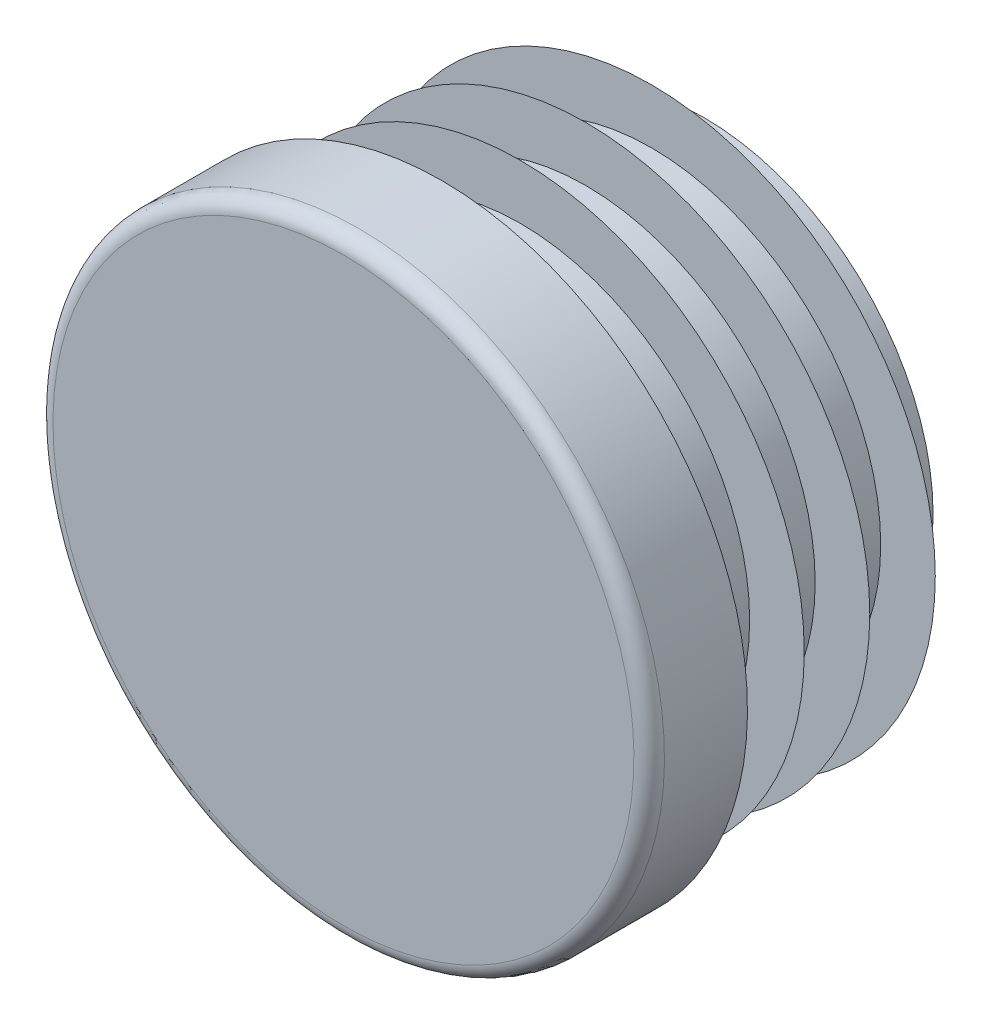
ISO-10303-21;
HEADER;
FILE_DESCRIPTION(('STEP AP214'),'2;1');
FILE_NAME('part.step','',(''),(''),'','','');
FILE_SCHEMA(('AUTOMOTIVE_DESIGN { 1 0 10303 214 1 1 1 1 }'));
ENDSEC;
DATA;
#1=APPLICATION_CONTEXT('core data for automotive mechanical design processes');
#2=APPLICATION_PROTOCOL_DEFINITION('international standard','automotive_design',2000,#1);
#3=PRODUCT_CONTEXT('',#1,'mechanical');
#4=PRODUCT('Part','Part','',(#3));
#5=PRODUCT_RELATED_PRODUCT_CATEGORY('part','',(#4));
#6=PRODUCT_DEFINITION_FORMATION('','',#4);
#7=PRODUCT_DEFINITION_CONTEXT('part definition',#1,'design');
#8=PRODUCT_DEFINITION('design','',#6,#7);
#9=PRODUCT_DEFINITION_SHAPE('','',#8);
#10=(LENGTH_UNIT() NAMED_UNIT(*) SI_UNIT(.MILLI.,.METRE.));
#11=(NAMED_UNIT(*) PLANE_ANGLE_UNIT() SI_UNIT($,.RADIAN.));
#12=(NAMED_UNIT(*) SI_UNIT($,.STERADIAN.) SOLID_ANGLE_UNIT());
#13=UNCERTAINTY_MEASURE_WITH_UNIT(LENGTH_MEASURE(1.E-05),#10,'distance_accuracy_value','');
#14=(GEOMETRIC_REPRESENTATION_CONTEXT(3) GLOBAL_UNCERTAINTY_ASSIGNED_CONTEXT((#13)) GLOBAL_UNIT_ASSIGNED_CONTEXT((#10,
#11,#12)) REPRESENTATION_CONTEXT('',''));
#15=CARTESIAN_POINT('',(0.,0.,0.));
#16=DIRECTION('',(0.,0.,1.));
#17=DIRECTION('',(1.,0.,0.));
#18=AXIS2_PLACEMENT_3D('',#15,#16,#17);
#19=CARTESIAN_POINT('',(0.,0.,4.5));
#20=DIRECTION('',(0.,0.,-1.));
#21=DIRECTION('',(0.,1.,0.));
#22=AXIS2_PLACEMENT_3D('',#19,#20,#21);
#23=PLANE('',#22);
#24=CARTESIAN_POINT('',(0.,0.,4.5));
#25=DIRECTION('',(0.,0.,-1.));
#26=DIRECTION('',(0.,1.,0.));
#27=AXIS2_PLACEMENT_3D('',#24,#25,#26);
#28=CIRCLE('',#27,13.3);
#29=CARTESIAN_POINT('',(0.,13.3,4.5));
#30=VERTEX_POINT('',#29);
#31=EDGE_CURVE('E8',#30,#30,#28,.T.);
#32=ORIENTED_EDGE('',*,*,#31,.F.);
#33=EDGE_LOOP('',(#32));
#34=FACE_BOUND('',#33,.T.);
#35=ADVANCED_FACE('F12',(#34),#23,.F.);
#36=CARTESIAN_POINT('',(0.,0.,3.8));
#37=DIRECTION('',(0.,0.,-1.));
#38=DIRECTION('',(0.,1.,0.));
#39=AXIS2_PLACEMENT_3D('',#36,#37,#38);
#40=TOROIDAL_SURFACE('',#39,13.3,0.7);
#41=ORIENTED_EDGE('',*,*,#31,.T.);
#42=EDGE_LOOP('',(#41));
#43=FACE_BOUND('',#42,.T.);
#44=CARTESIAN_POINT('',(0.,0.,3.8));
#45=DIRECTION('',(0.,0.,-1.));
#46=DIRECTION('',(0.,1.,0.));
#47=AXIS2_PLACEMENT_3D('',#44,#45,#46);
#48=CIRCLE('',#47,14.);
#49=CARTESIAN_POINT('',(0.,14.,3.8));
#50=VERTEX_POINT('',#49);
#51=EDGE_CURVE('E18',#50,#50,#48,.T.);
#52=ORIENTED_EDGE('',*,*,#51,.F.);
#53=EDGE_LOOP('',(#52));
#54=FACE_BOUND('',#53,.T.);
#55=ADVANCED_FACE('F159',(#43,#54),#40,.T.);
#56=CARTESIAN_POINT('',(0.,0.,-12.));
#57=DIRECTION('',(0.,0.,-1.));
#58=DIRECTION('',(0.,1.,0.));
#59=AXIS2_PLACEMENT_3D('',#56,#57,#58);
#60=CYLINDRICAL_SURFACE('',#59,14.);
#61=CARTESIAN_POINT('',(0.,0.,0.));
#62=DIRECTION('',(0.,0.,-1.));
#63=DIRECTION('',(0.,1.,0.));
#64=AXIS2_PLACEMENT_3D('',#61,#62,#63);
#65=CIRCLE('',#64,14.);
#66=CARTESIAN_POINT('',(0.,14.,0.));
#67=VERTEX_POINT('',#66);
#68=EDGE_CURVE('E22',#67,#67,#65,.T.);
#69=ORIENTED_EDGE('',*,*,#68,.F.);
#70=EDGE_LOOP('',(#69));
#71=FACE_BOUND('',#70,.T.);
#72=ORIENTED_EDGE('',*,*,#51,.T.);
#73=EDGE_LOOP('',(#72));
#74=FACE_BOUND('',#73,.T.);
#75=ADVANCED_FACE('F154',(#71,#74),#60,.T.);
#76=CARTESIAN_POINT('',(14.,0.,0.));
#77=DIRECTION('',(0.,0.,1.));
#78=DIRECTION('',(0.,-1.,0.));
#79=AXIS2_PLACEMENT_3D('',#76,#77,#78);
#80=PLANE('',#79);
#81=CARTESIAN_POINT('',(0.,0.,0.));
#82=DIRECTION('',(0.,0.,-1.));
#83=DIRECTION('',(0.,1.,0.));
#84=AXIS2_PLACEMENT_3D('',#81,#82,#83);
#85=CIRCLE('',#84,10.5);
#86=CARTESIAN_POINT('',(0.,10.5,0.));
#87=VERTEX_POINT('',#86);
#88=EDGE_CURVE('E26',#87,#87,#85,.T.);
#89=ORIENTED_EDGE('',*,*,#88,.F.);
#90=EDGE_LOOP('',(#89));
#91=FACE_BOUND('',#90,.T.);
#92=ORIENTED_EDGE('',*,*,#68,.T.);
#93=EDGE_LOOP('',(#92));
#94=FACE_BOUND('',#93,.T.);
#95=ADVANCED_FACE('F148',(#91,#94),#80,.F.);
#96=CARTESIAN_POINT('',(0.,0.,-12.));
#97=DIRECTION('',(0.,0.,-1.));
#98=DIRECTION('',(0.,1.,0.));
#99=AXIS2_PLACEMENT_3D('',#96,#97,#98);
#100=CYLINDRICAL_SURFACE('',#99,10.5);
#101=CARTESIAN_POINT('',(0.,0.,-0.6));
#102=DIRECTION('',(0.,0.,-1.));
#103=DIRECTION('',(0.,1.,0.));
#104=AXIS2_PLACEMENT_3D('',#101,#102,#103);
#105=CIRCLE('',#104,10.5);
#106=CARTESIAN_POINT('',(0.,10.5,-0.6));
#107=VERTEX_POINT('',#106);
#108=EDGE_CURVE('E31',#107,#107,#105,.T.);
#109=ORIENTED_EDGE('',*,*,#108,.F.);
#110=EDGE_LOOP('',(#109));
#111=FACE_BOUND('',#110,.T.);
#112=ORIENTED_EDGE('',*,*,#88,.T.);
#113=EDGE_LOOP('',(#112));
#114=FACE_BOUND('',#113,.T.);
#115=ADVANCED_FACE('F142',(#111,#114),#100,.T.);
#116=CARTESIAN_POINT('',(10.5,0.,-0.6));
#117=DIRECTION('',(0.,0.,-1.));
#118=DIRECTION('',(0.,1.,0.));
#119=AXIS2_PLACEMENT_3D('',#116,#117,#118);
#120=PLANE('',#119);
#121=CARTESIAN_POINT('',(0.,0.,-0.6));
#122=DIRECTION('',(0.,0.,-1.));
#123=DIRECTION('',(0.,1.,0.));
#124=AXIS2_PLACEMENT_3D('',#121,#122,#123);
#125=CIRCLE('',#124,13.);
#126=CARTESIAN_POINT('',(0.,13.,-0.6));
#127=VERTEX_POINT('',#126);
#128=EDGE_CURVE('E34',#127,#127,#125,.T.);
#129=ORIENTED_EDGE('',*,*,#128,.F.);
#130=EDGE_LOOP('',(#129));
#131=FACE_BOUND('',#130,.T.);
#132=ORIENTED_EDGE('',*,*,#108,.T.);
#133=EDGE_LOOP('',(#132));
#134=FACE_BOUND('',#133,.T.);
#135=ADVANCED_FACE('F136',(#131,#134),#120,.F.);
#136=CARTESIAN_POINT('',(0.,0.,-0.6));
#137=DIRECTION('',(0.,0.,1.));
#138=DIRECTION('',(0.,-1.,0.));
#139=AXIS2_PLACEMENT_3D('',#136,#137,#138);
#140=CONICAL_SURFACE('',#139,13.,0.959931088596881);
#141=CARTESIAN_POINT('',(0.,0.,-2.35051884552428));
#142=DIRECTION('',(0.,0.,-1.));
#143=DIRECTION('',(0.,1.,0.));
#144=AXIS2_PLACEMENT_3D('',#141,#142,#143);
#145=CIRCLE('',#144,10.5);
#146=CARTESIAN_POINT('',(0.,10.5,-2.35051884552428));
#147=VERTEX_POINT('',#146);
#148=EDGE_CURVE('E37',#147,#147,#145,.T.);
#149=ORIENTED_EDGE('',*,*,#148,.F.);
#150=EDGE_LOOP('',(#149));
#151=FACE_BOUND('',#150,.T.);
#152=ORIENTED_EDGE('',*,*,#128,.T.);
#153=EDGE_LOOP('',(#152));
#154=FACE_BOUND('',#153,.T.);
#155=ADVANCED_FACE('F130',(#151,#154),#140,.T.);
#156=CARTESIAN_POINT('',(0.,0.,-12.));
#157=DIRECTION('',(0.,0.,-1.));
#158=DIRECTION('',(0.,1.,0.));
#159=AXIS2_PLACEMENT_3D('',#156,#157,#158);
#160=CYLINDRICAL_SURFACE('',#159,10.5);
#161=CARTESIAN_POINT('',(0.,0.,-3.6));
#162=DIRECTION('',(0.,0.,-1.));
#163=DIRECTION('',(0.,1.,0.));
#164=AXIS2_PLACEMENT_3D('',#161,#162,#163);
#165=CIRCLE('',#164,10.5);
#166=CARTESIAN_POINT('',(0.,10.5,-3.6));
#167=VERTEX_POINT('',#166);
#168=EDGE_CURVE('E40',#167,#167,#165,.T.);
#169=ORIENTED_EDGE('',*,*,#168,.F.);
#170=EDGE_LOOP('',(#169));
#171=FACE_BOUND('',#170,.T.);
#172=ORIENTED_EDGE('',*,*,#148,.T.);
#173=EDGE_LOOP('',(#172));
#174=FACE_BOUND('',#173,.T.);
#175=ADVANCED_FACE('F124',(#171,#174),#160,.T.);
#176=CARTESIAN_POINT('',(10.5,0.,-3.6));
#177=DIRECTION('',(0.,0.,-1.));
#178=DIRECTION('',(0.,1.,0.));
#179=AXIS2_PLACEMENT_3D('',#176,#177,#178);
#180=PLANE('',#179);
#181=CARTESIAN_POINT('',(0.,0.,-3.6));
#182=DIRECTION('',(0.,0.,-1.));
#183=DIRECTION('',(0.,1.,0.));
#184=AXIS2_PLACEMENT_3D('',#181,#182,#183);
#185=CIRCLE('',#184,13.);
#186=CARTESIAN_POINT('',(0.,13.,-3.6));
#187=VERTEX_POINT('',#186);
#188=EDGE_CURVE('E43',#187,#187,#185,.T.);
#189=ORIENTED_EDGE('',*,*,#188,.F.);
#190=EDGE_LOOP('',(#189));
#191=FACE_BOUND('',#190,.T.);
#192=ORIENTED_EDGE('',*,*,#168,.T.);
#193=EDGE_LOOP('',(#192));
#194=FACE_BOUND('',#193,.T.);
#195=ADVANCED_FACE('F118',(#191,#194),#180,.F.);
#196=CARTESIAN_POINT('',(0.,0.,-3.6));
#197=DIRECTION('',(0.,0.,1.));
#198=DIRECTION('',(0.,-1.,0.));
#199=AXIS2_PLACEMENT_3D('',#196,#197,#198);
#200=CONICAL_SURFACE('',#199,13.,0.959931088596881);
#201=CARTESIAN_POINT('',(0.,0.,-5.35051884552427));
#202=DIRECTION('',(0.,0.,-1.));
#203=DIRECTION('',(0.,1.,0.));
#204=AXIS2_PLACEMENT_3D('',#201,#202,#203);
#205=CIRCLE('',#204,10.5);
#206=CARTESIAN_POINT('',(0.,10.5,-5.35051884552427));
#207=VERTEX_POINT('',#206);
#208=EDGE_CURVE('E46',#207,#207,#205,.T.);
#209=ORIENTED_EDGE('',*,*,#208,.F.);
#210=EDGE_LOOP('',(#209));
#211=FACE_BOUND('',#210,.T.);
#212=ORIENTED_EDGE('',*,*,#188,.T.);
#213=EDGE_LOOP('',(#212));
#214=FACE_BOUND('',#213,.T.);
#215=ADVANCED_FACE('F112',(#211,#214),#200,.T.);
#216=CARTESIAN_POINT('',(0.,0.,-12.));
#217=DIRECTION('',(0.,0.,-1.));
#218=DIRECTION('',(0.,1.,0.));
#219=AXIS2_PLACEMENT_3D('',#216,#217,#218);
#220=CYLINDRICAL_SURFACE('',#219,10.5);
#221=CARTESIAN_POINT('',(0.,0.,-6.6));
#222=DIRECTION('',(0.,0.,-1.));
#223=DIRECTION('',(0.,1.,0.));
#224=AXIS2_PLACEMENT_3D('',#221,#222,#223);
#225=CIRCLE('',#224,10.5);
#226=CARTESIAN_POINT('',(0.,10.5,-6.6));
#227=VERTEX_POINT('',#226);
#228=EDGE_CURVE('E49',#227,#227,#225,.T.);
#229=ORIENTED_EDGE('',*,*,#228,.F.);
#230=EDGE_LOOP('',(#229));
#231=FACE_BOUND('',#230,.T.);
#232=ORIENTED_EDGE('',*,*,#208,.T.);
#233=EDGE_LOOP('',(#232));
#234=FACE_BOUND('',#233,.T.);
#235=ADVANCED_FACE('F106',(#231,#234),#220,.T.);
#236=CARTESIAN_POINT('',(10.5,0.,-6.6));
#237=DIRECTION('',(0.,0.,-1.));
#238=DIRECTION('',(0.,1.,0.));
#239=AXIS2_PLACEMENT_3D('',#236,#237,#238);
#240=PLANE('',#239);
#241=CARTESIAN_POINT('',(0.,0.,-6.6));
#242=DIRECTION('',(0.,0.,-1.));
#243=DIRECTION('',(0.,1.,0.));
#244=AXIS2_PLACEMENT_3D('',#241,#242,#243);
#245=CIRCLE('',#244,13.);
#246=CARTESIAN_POINT('',(0.,13.,-6.6));
#247=VERTEX_POINT('',#246);
#248=EDGE_CURVE('E52',#247,#247,#245,.T.);
#249=ORIENTED_EDGE('',*,*,#248,.F.);
#250=EDGE_LOOP('',(#249));
#251=FACE_BOUND('',#250,.T.);
#252=ORIENTED_EDGE('',*,*,#228,.T.);
#253=EDGE_LOOP('',(#252));
#254=FACE_BOUND('',#253,.T.);
#255=ADVANCED_FACE('F100',(#251,#254),#240,.F.);
#256=CARTESIAN_POINT('',(0.,0.,-6.6));
#257=DIRECTION('',(0.,0.,1.));
#258=DIRECTION('',(0.,-1.,0.));
#259=AXIS2_PLACEMENT_3D('',#256,#257,#258);
#260=CONICAL_SURFACE('',#259,13.,0.959931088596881);
#261=CARTESIAN_POINT('',(0.,0.,-8.35051884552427));
#262=DIRECTION('',(0.,0.,-1.));
#263=DIRECTION('',(0.,1.,0.));
#264=AXIS2_PLACEMENT_3D('',#261,#262,#263);
#265=CIRCLE('',#264,10.5);
#266=CARTESIAN_POINT('',(0.,10.5,-8.35051884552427));
#267=VERTEX_POINT('',#266);
#268=EDGE_CURVE('E55',#267,#267,#265,.T.);
#269=ORIENTED_EDGE('',*,*,#268,.F.);
#270=EDGE_LOOP('',(#269));
#271=FACE_BOUND('',#270,.T.);
#272=ORIENTED_EDGE('',*,*,#248,.T.);
#273=EDGE_LOOP('',(#272));
#274=FACE_BOUND('',#273,.T.);
#275=ADVANCED_FACE('F94',(#271,#274),#260,.T.);
#276=CARTESIAN_POINT('',(0.,0.,-12.));
#277=DIRECTION('',(0.,0.,-1.));
#278=DIRECTION('',(0.,1.,0.));
#279=AXIS2_PLACEMENT_3D('',#276,#277,#278);
#280=CYLINDRICAL_SURFACE('',#279,10.5);
#281=CARTESIAN_POINT('',(0.,0.,-9.6));
#282=DIRECTION('',(0.,0.,-1.));
#283=DIRECTION('',(0.,1.,0.));
#284=AXIS2_PLACEMENT_3D('',#281,#282,#283);
#285=CIRCLE('',#284,10.5);
#286=CARTESIAN_POINT('',(0.,10.5,-9.6));
#287=VERTEX_POINT('',#286);
#288=EDGE_CURVE('E58',#287,#287,#285,.T.);
#289=ORIENTED_EDGE('',*,*,#288,.F.);
#290=EDGE_LOOP('',(#289));
#291=FACE_BOUND('',#290,.T.);
#292=ORIENTED_EDGE('',*,*,#268,.T.);
#293=EDGE_LOOP('',(#292));
#294=FACE_BOUND('',#293,.T.);
#295=ADVANCED_FACE('F88',(#291,#294),#280,.T.);
#296=CARTESIAN_POINT('',(10.5,0.,-9.6));
#297=DIRECTION('',(0.,0.,-1.));
#298=DIRECTION('',(0.,1.,0.));
#299=AXIS2_PLACEMENT_3D('',#296,#297,#298);
#300=PLANE('',#299);
#301=CARTESIAN_POINT('',(0.,0.,-9.6));
#302=DIRECTION('',(0.,0.,-1.));
#303=DIRECTION('',(0.,1.,0.));
#304=AXIS2_PLACEMENT_3D('',#301,#302,#303);
#305=CIRCLE('',#304,13.);
#306=CARTESIAN_POINT('',(0.,13.,-9.6));
#307=VERTEX_POINT('',#306);
#308=EDGE_CURVE('E61',#307,#307,#305,.T.);
#309=ORIENTED_EDGE('',*,*,#308,.F.);
#310=EDGE_LOOP('',(#309));
#311=FACE_BOUND('',#310,.T.);
#312=ORIENTED_EDGE('',*,*,#288,.T.);
#313=EDGE_LOOP('',(#312));
#314=FACE_BOUND('',#313,.T.);
#315=ADVANCED_FACE('F82',(#311,#314),#300,.F.);
#316=CARTESIAN_POINT('',(0.,0.,-9.6));
#317=DIRECTION('',(0.,0.,1.));
#318=DIRECTION('',(0.,-1.,0.));
#319=AXIS2_PLACEMENT_3D('',#316,#317,#318);
#320=CONICAL_SURFACE('',#319,13.,0.959931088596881);
#321=CARTESIAN_POINT('',(0.,0.,-11.3505188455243));
#322=DIRECTION('',(0.,0.,-1.));
#323=DIRECTION('',(0.,1.,0.));
#324=AXIS2_PLACEMENT_3D('',#321,#322,#323);
#325=CIRCLE('',#324,10.5);
#326=CARTESIAN_POINT('',(0.,10.5,-11.3505188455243));
#327=VERTEX_POINT('',#326);
#328=EDGE_CURVE('E64',#327,#327,#325,.T.);
#329=ORIENTED_EDGE('',*,*,#328,.F.);
#330=EDGE_LOOP('',(#329));
#331=FACE_BOUND('',#330,.T.);
#332=ORIENTED_EDGE('',*,*,#308,.T.);
#333=EDGE_LOOP('',(#332));
#334=FACE_BOUND('',#333,.T.);
#335=ADVANCED_FACE('F76',(#331,#334),#320,.T.);
#336=CARTESIAN_POINT('',(0.,0.,-12.));
#337=DIRECTION('',(0.,0.,-1.));
#338=DIRECTION('',(0.,1.,0.));
#339=AXIS2_PLACEMENT_3D('',#336,#337,#338);
#340=CYLINDRICAL_SURFACE('',#339,10.5);
#341=CARTESIAN_POINT('',(0.,0.,-12.));
#342=DIRECTION('',(0.,0.,-1.));
#343=DIRECTION('',(0.,1.,0.));
#344=AXIS2_PLACEMENT_3D('',#341,#342,#343);
#345=CIRCLE('',#344,10.5);
#346=CARTESIAN_POINT('',(0.,10.5,-12.));
#347=VERTEX_POINT('',#346);
#348=EDGE_CURVE('E67',#347,#347,#345,.T.);
#349=ORIENTED_EDGE('',*,*,#348,.F.);
#350=EDGE_LOOP('',(#349));
#351=FACE_BOUND('',#350,.T.);
#352=ORIENTED_EDGE('',*,*,#328,.T.);
#353=EDGE_LOOP('',(#352));
#354=FACE_BOUND('',#353,.T.);
#355=ADVANCED_FACE('F73',(#351,#354),#340,.T.);
#356=CARTESIAN_POINT('',(10.5,0.,-12.));
#357=DIRECTION('',(0.,0.,1.));
#358=DIRECTION('',(0.,-1.,0.));
#359=AXIS2_PLACEMENT_3D('',#356,#357,#358);
#360=PLANE('',#359);
#361=ORIENTED_EDGE('',*,*,#348,.T.);
#362=EDGE_LOOP('',(#361));
#363=FACE_BOUND('',#362,.T.);
#364=ADVANCED_FACE('F71',(#363),#360,.F.);
#365=CLOSED_SHELL('',(#35,#55,#75,#95,#115,#135,#155,#175,#195,#215,#235,#255,#275,#295,#315,
#335,#355,#364));
#366=MANIFOLD_SOLID_BREP('B1',#365);
#367=ADVANCED_BREP_SHAPE_REPRESENTATION('',(#18,#366),#14);
#368=SHAPE_DEFINITION_REPRESENTATION(#9,#367);
ENDSEC;
END-ISO-10303-21;
